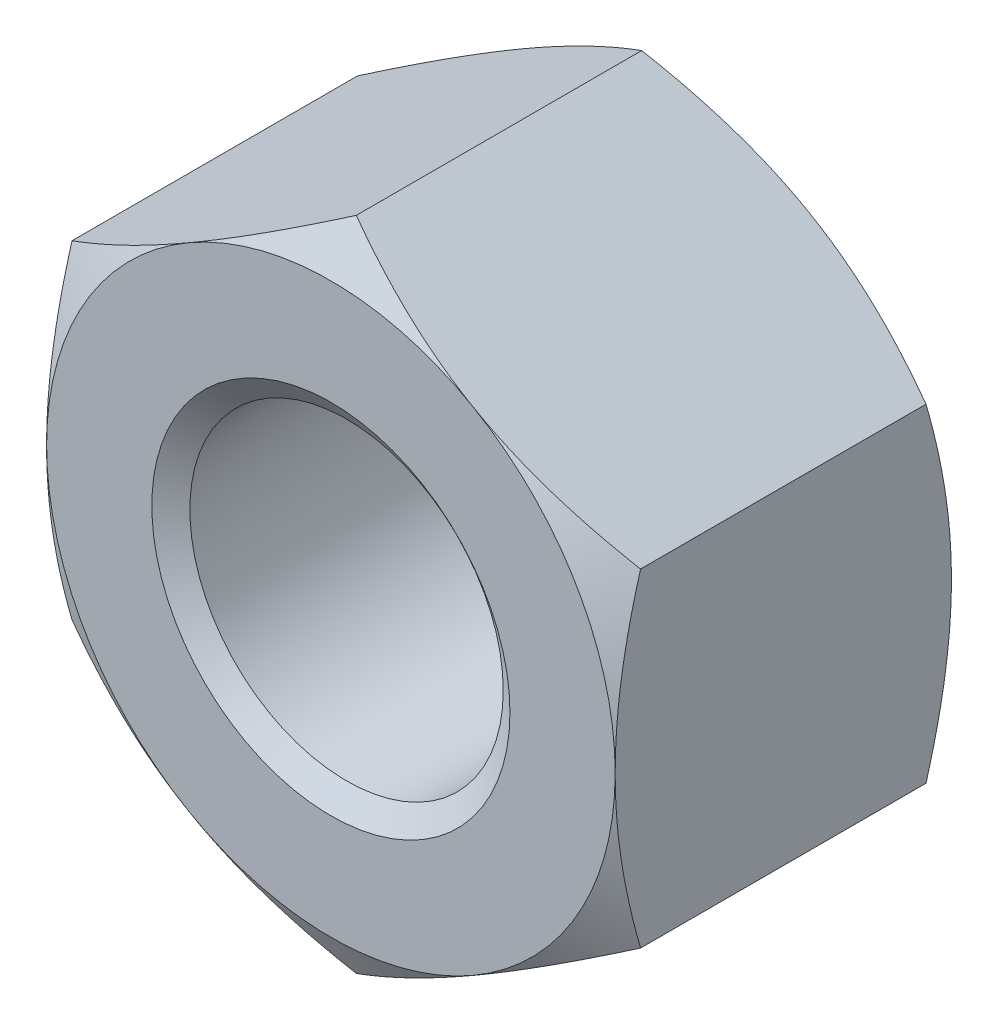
ISO-10303-21;
HEADER;
FILE_DESCRIPTION(('STEP AP214'),'2;1');
FILE_NAME('part.step','',(''),(''),'','','');
FILE_SCHEMA(('AUTOMOTIVE_DESIGN { 1 0 10303 214 1 1 1 1 }'));
ENDSEC;
DATA;
#1=APPLICATION_CONTEXT('core data for automotive mechanical design processes');
#2=APPLICATION_PROTOCOL_DEFINITION('international standard','automotive_design',2000,#1);
#3=PRODUCT_CONTEXT('',#1,'mechanical');
#4=PRODUCT('Part','Part','',(#3));
#5=PRODUCT_RELATED_PRODUCT_CATEGORY('part','',(#4));
#6=PRODUCT_DEFINITION_FORMATION('','',#4);
#7=PRODUCT_DEFINITION_CONTEXT('part definition',#1,'design');
#8=PRODUCT_DEFINITION('design','',#6,#7);
#9=PRODUCT_DEFINITION_SHAPE('','',#8);
#10=(LENGTH_UNIT() NAMED_UNIT(*) SI_UNIT(.MILLI.,.METRE.));
#11=(NAMED_UNIT(*) PLANE_ANGLE_UNIT() SI_UNIT($,.RADIAN.));
#12=(NAMED_UNIT(*) SI_UNIT($,.STERADIAN.) SOLID_ANGLE_UNIT());
#13=UNCERTAINTY_MEASURE_WITH_UNIT(LENGTH_MEASURE(1.E-05),#10,'distance_accuracy_value','');
#14=(GEOMETRIC_REPRESENTATION_CONTEXT(3) GLOBAL_UNCERTAINTY_ASSIGNED_CONTEXT((#13)) GLOBAL_UNIT_ASSIGNED_CONTEXT((#10,
#11,#12)) REPRESENTATION_CONTEXT('',''));
#15=CARTESIAN_POINT('',(0.,0.,0.));
#16=DIRECTION('',(0.,0.,1.));
#17=DIRECTION('',(1.,0.,0.));
#18=AXIS2_PLACEMENT_3D('',#15,#16,#17);
#19=CARTESIAN_POINT('',(0.,0.,-22.5298));
#20=DIRECTION('',(0.,0.,1.));
#21=DIRECTION('',(1.,0.,0.));
#22=AXIS2_PLACEMENT_3D('',#19,#20,#21);
#23=CYLINDRICAL_SURFACE('',#22,10.5);
#24=CARTESIAN_POINT('',(0.,0.,-1.05031130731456));
#25=DIRECTION('',(0.,0.,1.));
#26=DIRECTION('',(1.,0.,0.));
#27=AXIS2_PLACEMENT_3D('',#24,#25,#26);
#28=CIRCLE('',#27,10.5);
#29=CARTESIAN_POINT('',(10.5,0.,-1.05031130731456));
#30=VERTEX_POINT('',#29);
#31=EDGE_CURVE('E150',#30,#30,#28,.F.);
#32=ORIENTED_EDGE('',*,*,#31,.F.);
#33=EDGE_LOOP('',(#32));
#34=FACE_BOUND('',#33,.T.);
#35=CARTESIAN_POINT('',(0.,0.,-21.4540886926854));
#36=DIRECTION('',(0.,0.,-1.));
#37=DIRECTION('',(-1.,0.,0.));
#38=AXIS2_PLACEMENT_3D('',#35,#36,#37);
#39=CIRCLE('',#38,10.5);
#40=CARTESIAN_POINT('',(-10.5,0.,-21.4540886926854));
#41=VERTEX_POINT('',#40);
#42=EDGE_CURVE('E40',#41,#41,#39,.F.);
#43=ORIENTED_EDGE('',*,*,#42,.F.);
#44=EDGE_LOOP('',(#43));
#45=FACE_BOUND('',#44,.T.);
#46=ADVANCED_FACE('F35',(#34,#45),#23,.F.);
#47=CARTESIAN_POINT('',(-38.1,0.,-22.5298));
#48=DIRECTION('',(0.,0.,1.));
#49=DIRECTION('',(1.,0.,0.));
#50=AXIS2_PLACEMENT_3D('',#47,#48,#49);
#51=PLANE('',#50);
#52=CARTESIAN_POINT('',(0.,0.,-22.5298));
#53=DIRECTION('',(0.,0.,1.));
#54=DIRECTION('',(1.,0.,0.));
#55=AXIS2_PLACEMENT_3D('',#52,#53,#54);
#56=CIRCLE('',#55,19.05);
#57=CARTESIAN_POINT('',(19.05,0.,-22.5298));
#58=VERTEX_POINT('',#57);
#59=CARTESIAN_POINT('',(9.52500000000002,16.4977839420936,-22.5298));
#60=VERTEX_POINT('',#59);
#61=EDGE_CURVE('E157',#58,#60,#56,.T.);
#62=ORIENTED_EDGE('',*,*,#61,.F.);
#63=CARTESIAN_POINT('',(0.,0.,-22.5298));
#64=DIRECTION('',(0.,0.,1.));
#65=DIRECTION('',(1.,0.,0.));
#66=AXIS2_PLACEMENT_3D('',#63,#64,#65);
#67=CIRCLE('',#66,19.05);
#68=CARTESIAN_POINT('',(9.52500000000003,-16.4977839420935,-22.5298));
#69=VERTEX_POINT('',#68);
#70=EDGE_CURVE('E262',#58,#69,#67,.F.);
#71=ORIENTED_EDGE('',*,*,#70,.T.);
#72=CARTESIAN_POINT('',(-9.52500000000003,-16.4977839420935,-22.5298));
#73=VERTEX_POINT('',#72);
#74=EDGE_CURVE('E264',#69,#73,#67,.F.);
#75=ORIENTED_EDGE('',*,*,#74,.T.);
#76=CARTESIAN_POINT('',(-19.05,0.,-22.5298));
#77=VERTEX_POINT('',#76);
#78=EDGE_CURVE('E389',#73,#77,#67,.F.);
#79=ORIENTED_EDGE('',*,*,#78,.T.);
#80=CARTESIAN_POINT('',(-9.52500000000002,16.4977839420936,-22.5298));
#81=VERTEX_POINT('',#80);
#82=EDGE_CURVE('E392',#77,#81,#67,.F.);
#83=ORIENTED_EDGE('',*,*,#82,.T.);
#84=EDGE_CURVE('E247',#81,#60,#67,.F.);
#85=ORIENTED_EDGE('',*,*,#84,.T.);
#86=EDGE_LOOP('',(#62,#71,#75,#79,#83,#85));
#87=FACE_BOUND('',#86,.T.);
#88=CARTESIAN_POINT('',(0.,0.,-22.5298));
#89=DIRECTION('',(0.,0.,1.));
#90=DIRECTION('',(1.,0.,0.));
#91=AXIS2_PLACEMENT_3D('',#88,#89,#90);
#92=CIRCLE('',#91,12.);
#93=CARTESIAN_POINT('',(12.,0.,-22.5298));
#94=VERTEX_POINT('',#93);
#95=EDGE_CURVE('E269',#94,#94,#92,.F.);
#96=ORIENTED_EDGE('',*,*,#95,.F.);
#97=EDGE_LOOP('',(#96));
#98=FACE_BOUND('',#97,.T.);
#99=ADVANCED_FACE('F285',(#87,#98),#51,.F.);
#100=CARTESIAN_POINT('',(-38.1,0.,0.));
#101=DIRECTION('',(0.,0.,1.));
#102=DIRECTION('',(1.,0.,0.));
#103=AXIS2_PLACEMENT_3D('',#100,#101,#102);
#104=PLANE('',#103);
#105=CARTESIAN_POINT('',(0.,0.,0.));
#106=DIRECTION('',(0.,0.,1.));
#107=DIRECTION('',(1.,0.,0.));
#108=AXIS2_PLACEMENT_3D('',#105,#106,#107);
#109=CIRCLE('',#108,19.05);
#110=CARTESIAN_POINT('',(9.52500000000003,-16.4977839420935,0.));
#111=VERTEX_POINT('',#110);
#112=CARTESIAN_POINT('',(19.05,0.,0.));
#113=VERTEX_POINT('',#112);
#114=EDGE_CURVE('E47',#111,#113,#109,.T.);
#115=ORIENTED_EDGE('',*,*,#114,.T.);
#116=CARTESIAN_POINT('',(0.,0.,0.));
#117=DIRECTION('',(0.,0.,1.));
#118=DIRECTION('',(1.,0.,0.));
#119=AXIS2_PLACEMENT_3D('',#116,#117,#118);
#120=CIRCLE('',#119,19.05);
#121=CARTESIAN_POINT('',(9.52500000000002,16.4977839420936,0.));
#122=VERTEX_POINT('',#121);
#123=EDGE_CURVE('E54',#113,#122,#120,.T.);
#124=ORIENTED_EDGE('',*,*,#123,.T.);
#125=CARTESIAN_POINT('',(-9.52500000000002,16.4977839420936,0.));
#126=VERTEX_POINT('',#125);
#127=EDGE_CURVE('E11',#122,#126,#109,.T.);
#128=ORIENTED_EDGE('',*,*,#127,.T.);
#129=CARTESIAN_POINT('',(-19.05,0.,0.));
#130=VERTEX_POINT('',#129);
#131=EDGE_CURVE('E45',#126,#130,#109,.T.);
#132=ORIENTED_EDGE('',*,*,#131,.T.);
#133=CARTESIAN_POINT('',(-9.52500000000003,-16.4977839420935,0.));
#134=VERTEX_POINT('',#133);
#135=EDGE_CURVE('E338',#130,#134,#109,.T.);
#136=ORIENTED_EDGE('',*,*,#135,.T.);
#137=EDGE_CURVE('E266',#134,#111,#109,.T.);
#138=ORIENTED_EDGE('',*,*,#137,.T.);
#139=EDGE_LOOP('',(#115,#124,#128,#132,#136,#138));
#140=FACE_BOUND('',#139,.T.);
#141=CARTESIAN_POINT('',(0.,0.,0.));
#142=DIRECTION('',(0.,0.,1.));
#143=DIRECTION('',(1.,0.,0.));
#144=AXIS2_PLACEMENT_3D('',#141,#142,#143);
#145=CIRCLE('',#144,12.);
#146=CARTESIAN_POINT('',(12.,0.,0.));
#147=VERTEX_POINT('',#146);
#148=EDGE_CURVE('E268',#147,#147,#145,.T.);
#149=ORIENTED_EDGE('',*,*,#148,.F.);
#150=EDGE_LOOP('',(#149));
#151=FACE_BOUND('',#150,.T.);
#152=ADVANCED_FACE('F145',(#140,#151),#104,.T.);
#153=CARTESIAN_POINT('',(0.,21.9970452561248,-22.5298));
#154=DIRECTION('',(-0.500000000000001,0.866025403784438,0.));
#155=DIRECTION('',(-0.866025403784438,-0.500000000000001,0.));
#156=AXIS2_PLACEMENT_3D('',#153,#154,#155);
#157=PLANE('',#156);
#158=DIRECTION('',(0.,0.,1.));
#159=VECTOR('',#158,1.);
#160=CARTESIAN_POINT('',(-19.05,10.9985226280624,-22.5298));
#161=LINE('',#160,#159);
#162=CARTESIAN_POINT('',(-19.05,10.9985226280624,-20.8283226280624));
#163=VERTEX_POINT('',#162);
#164=CARTESIAN_POINT('',(-19.05,10.9985226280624,-1.70147737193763));
#165=VERTEX_POINT('',#164);
#166=EDGE_CURVE('E259',#163,#165,#161,.T.);
#167=ORIENTED_EDGE('',*,*,#166,.T.);
#168=CARTESIAN_POINT('',(-19.0502,10.9984071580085,-1.70154403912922));
#169=CARTESIAN_POINT('',(-18.6314889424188,11.2401500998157,-1.56198341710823));
#170=CARTESIAN_POINT('',(-18.2111446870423,11.4828359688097,-1.42875584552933));
#171=CARTESIAN_POINT('',(-17.3670855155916,11.9701537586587,-1.17672716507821));
#172=CARTESIAN_POINT('',(-16.9433695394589,12.2147862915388,-1.05793080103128));
#173=CARTESIAN_POINT('',(-16.0917480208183,12.7064702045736,-0.836361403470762));
#174=CARTESIAN_POINT('',(-15.6638350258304,12.9535258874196,-0.733626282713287));
#175=CARTESIAN_POINT('',(-14.8050356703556,13.4493539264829,-0.546385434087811));
#176=CARTESIAN_POINT('',(-14.374149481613,13.6981261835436,-0.461878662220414));
#177=CARTESIAN_POINT('',(-13.5204444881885,14.1910129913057,-0.314688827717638));
#178=CARTESIAN_POINT('',(-13.0976890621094,14.4350909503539,-0.251518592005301));
#179=CARTESIAN_POINT('',(-12.250241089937,14.9243652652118,-0.14559634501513));
#180=CARTESIAN_POINT('',(-11.8255485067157,15.1695616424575,-0.102844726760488));
#181=CARTESIAN_POINT('',(-10.9754499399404,15.6603662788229,-0.0388391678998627));
#182=CARTESIAN_POINT('',(-10.5500454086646,15.9059736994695,-0.017559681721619));
#183=CARTESIAN_POINT('',(-9.6988436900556,16.397415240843,0.00304398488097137));
#184=CARTESIAN_POINT('',(-9.27304651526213,16.6432493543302,0.00236884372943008));
#185=CARTESIAN_POINT('',(-8.47700964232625,17.1028414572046,-0.0194033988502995));
#186=CARTESIAN_POINT('',(-8.10671322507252,17.316632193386,-0.0378455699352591));
#187=CARTESIAN_POINT('',(-7.36700369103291,17.7437036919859,-0.0909844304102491));
#188=CARTESIAN_POINT('',(-6.99759056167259,17.9569844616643,-0.125680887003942));
#189=CARTESIAN_POINT('',(-6.25978756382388,18.3829552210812,-0.21072627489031));
#190=CARTESIAN_POINT('',(-5.89139892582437,18.5956445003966,-0.261089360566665));
#191=CARTESIAN_POINT('',(-5.15637533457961,19.0200105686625,-0.376579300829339));
#192=CARTESIAN_POINT('',(-4.78974037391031,19.2316873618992,-0.441706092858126));
#193=CARTESIAN_POINT('',(-3.67677271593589,19.8742595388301,-0.660888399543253));
#194=CARTESIAN_POINT('',(-2.93366305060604,20.3032941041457,-0.836799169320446));
#195=CARTESIAN_POINT('',(-1.45852420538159,21.1549659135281,-1.23604434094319));
#196=CARTESIAN_POINT('',(-0.726476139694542,21.5776140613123,-1.45928498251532));
#197=CARTESIAN_POINT('',(0.000199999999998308,21.9971607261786,-1.70154403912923));
#198=B_SPLINE_CURVE_WITH_KNOTS('',3,(#168,#169,#170,#171,#172,#173,#174,#175,#176,#177,#178,
#179,#180,#181,#182,#183,#184,#185,#186,#187,#188,#189,#190,#191,#192,#193,#194,#195,#196,#197),
.UNSPECIFIED.,.F.,.F.,(4,2,2,2,2,2,2,2,2,2,2,2,2,2,4),(0.,1.50971559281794,3.01992622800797,
4.53364959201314,6.04728623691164,7.52356313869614,8.99986845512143,10.4744153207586,
11.9489166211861,13.2325441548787,14.5161533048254,15.8009255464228,17.085692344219,
19.7118183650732,22.3327898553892),.UNSPECIFIED.);
#199=EDGE_CURVE('E62',#165,#126,#198,.T.);
#200=ORIENTED_EDGE('',*,*,#199,.T.);
#201=CARTESIAN_POINT('',(0.,21.9970452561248,-1.70147737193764));
#202=VERTEX_POINT('',#201);
#203=EDGE_CURVE('E141',#126,#202,#198,.T.);
#204=ORIENTED_EDGE('',*,*,#203,.T.);
#205=DIRECTION('',(0.,0.,1.));
#206=VECTOR('',#205,1.);
#207=CARTESIAN_POINT('',(0.,21.9970452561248,-22.5298));
#208=LINE('',#207,#206);
#209=CARTESIAN_POINT('',(0.,21.9970452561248,-20.8283226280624));
#210=VERTEX_POINT('',#209);
#211=EDGE_CURVE('E156',#210,#202,#208,.T.);
#212=ORIENTED_EDGE('',*,*,#211,.F.);
#213=CARTESIAN_POINT('',(-19.0502,10.9984071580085,-20.8282559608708));
#214=CARTESIAN_POINT('',(-18.6314889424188,11.2401500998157,-20.9678165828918));
#215=CARTESIAN_POINT('',(-18.2111446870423,11.4828359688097,-21.1010441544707));
#216=CARTESIAN_POINT('',(-17.3670855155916,11.9701537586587,-21.3530728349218));
#217=CARTESIAN_POINT('',(-16.9433695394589,12.2147862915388,-21.4718691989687));
#218=CARTESIAN_POINT('',(-16.0917480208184,12.7064702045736,-21.6934385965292));
#219=CARTESIAN_POINT('',(-15.6638350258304,12.9535258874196,-21.7961737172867));
#220=CARTESIAN_POINT('',(-14.8050356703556,13.4493539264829,-21.9834145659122));
#221=CARTESIAN_POINT('',(-14.374149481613,13.6981261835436,-22.0679213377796));
#222=CARTESIAN_POINT('',(-13.5204444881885,14.1910129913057,-22.2151111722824));
#223=CARTESIAN_POINT('',(-13.0976890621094,14.4350909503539,-22.2782814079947));
#224=CARTESIAN_POINT('',(-12.250241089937,14.9243652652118,-22.3842036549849));
#225=CARTESIAN_POINT('',(-11.8255485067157,15.1695616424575,-22.4269552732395));
#226=CARTESIAN_POINT('',(-10.9754499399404,15.6603662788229,-22.4909608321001));
#227=CARTESIAN_POINT('',(-10.5500454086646,15.9059736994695,-22.5122403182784));
#228=CARTESIAN_POINT('',(-9.6988436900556,16.397415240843,-22.532843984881));
#229=CARTESIAN_POINT('',(-9.27304651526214,16.6432493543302,-22.5321688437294));
#230=CARTESIAN_POINT('',(-8.47700964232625,17.1028414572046,-22.5103966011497));
#231=CARTESIAN_POINT('',(-8.10671322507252,17.316632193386,-22.4919544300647));
#232=CARTESIAN_POINT('',(-7.3670036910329,17.7437036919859,-22.4388155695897));
#233=CARTESIAN_POINT('',(-6.99759056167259,17.9569844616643,-22.4041191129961));
#234=CARTESIAN_POINT('',(-6.25978756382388,18.3829552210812,-22.3190737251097));
#235=CARTESIAN_POINT('',(-5.89139892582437,18.5956445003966,-22.2687106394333));
#236=CARTESIAN_POINT('',(-5.15637533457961,19.0200105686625,-22.1532206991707));
#237=CARTESIAN_POINT('',(-4.78974037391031,19.2316873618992,-22.0880939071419));
#238=CARTESIAN_POINT('',(-3.67677271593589,19.8742595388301,-21.8689116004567));
#239=CARTESIAN_POINT('',(-2.93366305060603,20.3032941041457,-21.6930008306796));
#240=CARTESIAN_POINT('',(-1.45852420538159,21.1549659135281,-21.2937556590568));
#241=CARTESIAN_POINT('',(-0.72647613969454,21.5776140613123,-21.0705150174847));
#242=CARTESIAN_POINT('',(0.000199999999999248,21.9971607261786,-20.8282559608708));
#243=B_SPLINE_CURVE_WITH_KNOTS('',3,(#213,#214,#215,#216,#217,#218,#219,#220,#221,#222,#223,
#224,#225,#226,#227,#228,#229,#230,#231,#232,#233,#234,#235,#236,#237,#238,#239,#240,#241,#242),
.UNSPECIFIED.,.F.,.F.,(4,2,2,2,2,2,2,2,2,2,2,2,2,2,4),(0.,1.50971559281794,3.01992622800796,
4.53364959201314,6.04728623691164,7.52356313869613,8.99986845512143,10.4744153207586,
11.9489166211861,13.2325441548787,14.5161533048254,15.8009255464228,17.085692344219,
19.7118183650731,22.3327898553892),.UNSPECIFIED.);
#244=EDGE_CURVE('E239',#81,#210,#243,.T.);
#245=ORIENTED_EDGE('',*,*,#244,.F.);
#246=EDGE_CURVE('E227',#163,#81,#243,.T.);
#247=ORIENTED_EDGE('',*,*,#246,.F.);
#248=EDGE_LOOP('',(#167,#200,#204,#212,#245,#247));
#249=FACE_BOUND('',#248,.T.);
#250=ADVANCED_FACE('F37',(#249),#157,.T.);
#251=CARTESIAN_POINT('',(19.05,10.9985226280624,-22.5298));
#252=DIRECTION('',(0.500000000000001,0.866025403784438,0.));
#253=DIRECTION('',(-0.866025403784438,0.500000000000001,0.));
#254=AXIS2_PLACEMENT_3D('',#251,#252,#253);
#255=PLANE('',#254);
#256=ORIENTED_EDGE('',*,*,#211,.T.);
#257=CARTESIAN_POINT('',(-0.000200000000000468,21.9971607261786,-1.70154403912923));
#258=CARTESIAN_POINT('',(0.418511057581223,21.7554177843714,-1.56198341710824));
#259=CARTESIAN_POINT('',(0.83885531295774,21.5127319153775,-1.42875584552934));
#260=CARTESIAN_POINT('',(1.68291448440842,21.0254141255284,-1.17672716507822));
#261=CARTESIAN_POINT('',(2.10663046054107,20.7807815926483,-1.05793080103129));
#262=CARTESIAN_POINT('',(2.95825197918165,20.2890976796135,-0.836361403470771));
#263=CARTESIAN_POINT('',(3.38616497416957,20.0420419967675,-0.733626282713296));
#264=CARTESIAN_POINT('',(4.24496432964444,19.5462139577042,-0.546385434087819));
#265=CARTESIAN_POINT('',(4.67585051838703,19.2974417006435,-0.461878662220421));
#266=CARTESIAN_POINT('',(5.52955551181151,18.8045548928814,-0.314688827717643));
#267=CARTESIAN_POINT('',(5.95231093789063,18.5604769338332,-0.251518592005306));
#268=CARTESIAN_POINT('',(6.799758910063,18.0712026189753,-0.145596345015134));
#269=CARTESIAN_POINT('',(7.22445149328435,17.8260062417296,-0.102844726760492));
#270=CARTESIAN_POINT('',(8.07455006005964,17.3352016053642,-0.0388391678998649));
#271=CARTESIAN_POINT('',(8.49995459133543,17.0895941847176,-0.0175596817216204));
#272=CARTESIAN_POINT('',(9.35115630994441,16.5981526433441,0.00304398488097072));
#273=CARTESIAN_POINT('',(9.77695348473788,16.3523185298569,0.0023688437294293));
#274=CARTESIAN_POINT('',(10.5729903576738,15.8927264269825,-0.0194033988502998));
#275=CARTESIAN_POINT('',(10.9432867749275,15.6789356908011,-0.0378455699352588));
#276=CARTESIAN_POINT('',(11.6829963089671,15.2518641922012,-0.0909844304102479));
#277=CARTESIAN_POINT('',(12.0524094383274,15.0385834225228,-0.125680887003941));
#278=CARTESIAN_POINT('',(12.7902124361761,14.6126126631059,-0.210726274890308));
#279=CARTESIAN_POINT('',(13.1586010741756,14.3999233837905,-0.261089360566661));
#280=CARTESIAN_POINT('',(13.8936246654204,13.9755573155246,-0.376579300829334));
#281=CARTESIAN_POINT('',(14.2602596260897,13.7638805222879,-0.441706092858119));
#282=CARTESIAN_POINT('',(15.3732272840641,13.121308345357,-0.660888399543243));
#283=CARTESIAN_POINT('',(16.116336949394,12.6922737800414,-0.836799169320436));
#284=CARTESIAN_POINT('',(17.5914757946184,11.840601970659,-1.23604434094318));
#285=CARTESIAN_POINT('',(18.3235238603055,11.4179538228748,-1.45928498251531));
#286=CARTESIAN_POINT('',(19.0502,10.9984071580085,-1.70154403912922));
#287=B_SPLINE_CURVE_WITH_KNOTS('',3,(#257,#258,#259,#260,#261,#262,#263,#264,#265,#266,#267,
#268,#269,#270,#271,#272,#273,#274,#275,#276,#277,#278,#279,#280,#281,#282,#283,#284,#285,#286),
.UNSPECIFIED.,.F.,.F.,(4,2,2,2,2,2,2,2,2,2,2,2,2,2,4),(0.,1.50971559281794,3.01992622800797,
4.53364959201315,6.04728623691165,7.52356313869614,8.99986845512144,10.4744153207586,
11.9489166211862,13.2325441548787,14.5161533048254,15.8009255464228,17.085692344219,
19.7118183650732,22.3327898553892),.UNSPECIFIED.);
#288=EDGE_CURVE('E136',#202,#122,#287,.T.);
#289=ORIENTED_EDGE('',*,*,#288,.T.);
#290=CARTESIAN_POINT('',(19.05,10.9985226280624,-1.70147737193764));
#291=VERTEX_POINT('',#290);
#292=EDGE_CURVE('E127',#122,#291,#287,.T.);
#293=ORIENTED_EDGE('',*,*,#292,.T.);
#294=DIRECTION('',(0.,0.,1.));
#295=VECTOR('',#294,1.);
#296=CARTESIAN_POINT('',(19.05,10.9985226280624,-22.5298));
#297=LINE('',#296,#295);
#298=CARTESIAN_POINT('',(19.05,10.9985226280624,-20.8283226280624));
#299=VERTEX_POINT('',#298);
#300=EDGE_CURVE('E248',#299,#291,#297,.T.);
#301=ORIENTED_EDGE('',*,*,#300,.F.);
#302=CARTESIAN_POINT('',(-0.000200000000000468,21.9971607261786,-20.8282559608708));
#303=CARTESIAN_POINT('',(0.418511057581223,21.7554177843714,-20.9678165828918));
#304=CARTESIAN_POINT('',(0.83885531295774,21.5127319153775,-21.1010441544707));
#305=CARTESIAN_POINT('',(1.68291448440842,21.0254141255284,-21.3530728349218));
#306=CARTESIAN_POINT('',(2.10663046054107,20.7807815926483,-21.4718691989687));
#307=CARTESIAN_POINT('',(2.95825197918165,20.2890976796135,-21.6934385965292));
#308=CARTESIAN_POINT('',(3.38616497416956,20.0420419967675,-21.7961737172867));
#309=CARTESIAN_POINT('',(4.24496432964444,19.5462139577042,-21.9834145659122));
#310=CARTESIAN_POINT('',(4.67585051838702,19.2974417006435,-22.0679213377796));
#311=CARTESIAN_POINT('',(5.52955551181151,18.8045548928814,-22.2151111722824));
#312=CARTESIAN_POINT('',(5.95231093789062,18.5604769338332,-22.2782814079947));
#313=CARTESIAN_POINT('',(6.79975891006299,18.0712026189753,-22.3842036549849));
#314=CARTESIAN_POINT('',(7.22445149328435,17.8260062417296,-22.4269552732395));
#315=CARTESIAN_POINT('',(8.07455006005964,17.3352016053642,-22.4909608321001));
#316=CARTESIAN_POINT('',(8.49995459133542,17.0895941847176,-22.5122403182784));
#317=CARTESIAN_POINT('',(9.3511563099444,16.5981526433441,-22.532843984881));
#318=CARTESIAN_POINT('',(9.77695348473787,16.3523185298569,-22.5321688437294));
#319=CARTESIAN_POINT('',(10.5729903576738,15.8927264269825,-22.5103966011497));
#320=CARTESIAN_POINT('',(10.9432867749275,15.6789356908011,-22.4919544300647));
#321=CARTESIAN_POINT('',(11.6829963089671,15.2518641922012,-22.4388155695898));
#322=CARTESIAN_POINT('',(12.0524094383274,15.0385834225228,-22.4041191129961));
#323=CARTESIAN_POINT('',(12.7902124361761,14.612612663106,-22.3190737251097));
#324=CARTESIAN_POINT('',(13.1586010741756,14.3999233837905,-22.2687106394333));
#325=CARTESIAN_POINT('',(13.8936246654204,13.9755573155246,-22.1532206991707));
#326=CARTESIAN_POINT('',(14.2602596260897,13.7638805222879,-22.0880939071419));
#327=CARTESIAN_POINT('',(15.3732272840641,13.121308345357,-21.8689116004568));
#328=CARTESIAN_POINT('',(16.116336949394,12.6922737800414,-21.6930008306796));
#329=CARTESIAN_POINT('',(17.5914757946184,11.840601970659,-21.2937556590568));
#330=CARTESIAN_POINT('',(18.3235238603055,11.4179538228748,-21.0705150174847));
#331=CARTESIAN_POINT('',(19.0502,10.9984071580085,-20.8282559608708));
#332=B_SPLINE_CURVE_WITH_KNOTS('',3,(#302,#303,#304,#305,#306,#307,#308,#309,#310,#311,#312,
#313,#314,#315,#316,#317,#318,#319,#320,#321,#322,#323,#324,#325,#326,#327,#328,#329,#330,#331),
.UNSPECIFIED.,.F.,.F.,(4,2,2,2,2,2,2,2,2,2,2,2,2,2,4),(0.,1.50971559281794,3.01992622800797,
4.53364959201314,6.04728623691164,7.52356313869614,8.99986845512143,10.4744153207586,
11.9489166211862,13.2325441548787,14.5161533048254,15.8009255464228,17.085692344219,
19.7118183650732,22.3327898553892),.UNSPECIFIED.);
#333=EDGE_CURVE('E240',#60,#299,#332,.T.);
#334=ORIENTED_EDGE('',*,*,#333,.F.);
#335=EDGE_CURVE('E245',#210,#60,#332,.T.);
#336=ORIENTED_EDGE('',*,*,#335,.F.);
#337=EDGE_LOOP('',(#256,#289,#293,#301,#334,#336));
#338=FACE_BOUND('',#337,.T.);
#339=ADVANCED_FACE('F153',(#338),#255,.T.);
#340=CARTESIAN_POINT('',(19.05,10.9985226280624,-22.5298));
#341=DIRECTION('',(-1.,0.,0.));
#342=DIRECTION('',(0.,0.,1.));
#343=AXIS2_PLACEMENT_3D('',#340,#341,#342);
#344=PLANE('',#343);
#345=CARTESIAN_POINT('',(19.05,-29.169702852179,-9.11593373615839));
#346=CARTESIAN_POINT('',(19.05,-28.7515170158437,-8.91378890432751));
#347=CARTESIAN_POINT('',(19.05,-28.3328257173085,-8.71269026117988));
#348=CARTESIAN_POINT('',(19.05,-27.494325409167,-8.31282549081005));
#349=CARTESIAN_POINT('',(19.05,-27.0745163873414,-8.11405938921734));
#350=CARTESIAN_POINT('',(19.05,-25.813129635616,-7.52156252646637));
#351=CARTESIAN_POINT('',(19.05,-24.9697281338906,-7.13169909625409));
#352=CARTESIAN_POINT('',(19.05,-23.2722707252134,-6.36257122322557));
#353=CARTESIAN_POINT('',(19.05,-22.4181814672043,-5.98338020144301));
#354=CARTESIAN_POINT('',(19.05,-20.7029839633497,-5.24127883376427));
#355=CARTESIAN_POINT('',(19.05,-19.8418760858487,-4.87836763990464));
#356=CARTESIAN_POINT('',(19.05,-18.1005821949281,-4.1688569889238));
#357=CARTESIAN_POINT('',(19.05,-17.2202917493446,-3.82251248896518));
#358=CARTESIAN_POINT('',(19.05,-15.4493217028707,-3.15694792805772));
#359=CARTESIAN_POINT('',(19.05,-14.5586409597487,-2.83773088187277));
#360=CARTESIAN_POINT('',(19.05,-12.7673320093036,-2.2350028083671));
#361=CARTESIAN_POINT('',(19.05,-11.8667295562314,-1.95141586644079));
#362=CARTESIAN_POINT('',(19.05,-10.0526343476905,-1.42914392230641));
#363=CARTESIAN_POINT('',(19.05,-9.13914576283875,-1.19044473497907));
#364=CARTESIAN_POINT('',(19.05,-7.7590746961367,-0.874799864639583));
#365=CARTESIAN_POINT('',(19.05,-7.29731333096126,-0.776636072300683));
#366=CARTESIAN_POINT('',(19.05,-6.37071732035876,-0.595993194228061));
#367=CARTESIAN_POINT('',(19.05,-5.90588274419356,-0.513513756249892));
#368=CARTESIAN_POINT('',(19.05,-4.97345228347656,-0.365701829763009));
#369=CARTESIAN_POINT('',(19.05,-4.50585623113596,-0.300370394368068));
#370=CARTESIAN_POINT('',(19.05,-3.56843861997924,-0.188166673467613));
#371=CARTESIAN_POINT('',(19.05,-3.09861705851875,-0.141294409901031));
#372=CARTESIAN_POINT('',(19.05,-2.16041609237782,-0.0672708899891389));
#373=CARTESIAN_POINT('',(19.05,-1.69204648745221,-0.0399962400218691));
#374=CARTESIAN_POINT('',(19.05,-0.754574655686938,-0.00531133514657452));
#375=CARTESIAN_POINT('',(19.05,-0.285472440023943,0.00209921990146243));
#376=CARTESIAN_POINT('',(19.05,0.652492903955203,-0.00311981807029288));
#377=CARTESIAN_POINT('',(19.05,1.12135606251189,-0.0157438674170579));
#378=CARTESIAN_POINT('',(19.05,2.05813737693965,-0.0607182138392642));
#379=CARTESIAN_POINT('',(19.05,2.52605549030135,-0.0930693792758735));
#380=CARTESIAN_POINT('',(19.05,3.65980250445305,-0.194680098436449));
#381=CARTESIAN_POINT('',(19.05,4.32476458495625,-0.273803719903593));
#382=CARTESIAN_POINT('',(19.05,5.64947952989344,-0.467485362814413));
#383=CARTESIAN_POINT('',(19.05,6.30923160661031,-0.582048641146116));
#384=CARTESIAN_POINT('',(19.05,8.28182382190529,-0.973151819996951));
#385=CARTESIAN_POINT('',(19.05,9.58542312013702,-1.29684470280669));
#386=CARTESIAN_POINT('',(19.05,11.5353898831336,-1.85499845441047));
#387=CARTESIAN_POINT('',(19.05,12.191945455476,-2.05588340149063));
#388=CARTESIAN_POINT('',(19.05,13.498713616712,-2.47768236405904));
#389=CARTESIAN_POINT('',(19.05,14.1489256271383,-2.69859818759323));
#390=CARTESIAN_POINT('',(19.05,15.4397656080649,-3.15575174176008));
#391=CARTESIAN_POINT('',(19.05,16.0804269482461,-3.39189604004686));
#392=CARTESIAN_POINT('',(19.05,17.0373840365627,-3.75633654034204));
#393=CARTESIAN_POINT('',(19.05,17.3556458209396,-3.87949985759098));
#394=CARTESIAN_POINT('',(19.05,17.9909330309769,-4.12895791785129));
#395=CARTESIAN_POINT('',(19.05,18.3079584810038,-4.25525259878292));
#396=CARTESIAN_POINT('',(19.05,18.6244086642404,-4.38297164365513));
#397=B_SPLINE_CURVE_WITH_KNOTS('',3,(#345,#346,#347,#348,#349,#350,#351,#352,#353,#354,#355,
#356,#357,#358,#359,#360,#361,#362,#363,#364,#365,#366,#367,#368,#369,#370,#371,#372,#373,#374,
#375,#376,#377,#378,#379,#380,#381,#382,#383,#384,#385,#386,#387,#388,#389,#390,#391,#392,#393,
#394,#395,#396),.UNSPECIFIED.,.F.,.F.,(4,2,2,2,2,2,2,2,2,2,2,2,2,2,2,2,2,2,2,2,2,2,2,2,2,4),(0.,
1.39343811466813,2.78689152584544,5.57425145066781,8.37756231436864,11.1807269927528,
14.0183059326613,16.856199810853,19.6879407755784,22.5187853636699,23.934802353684,
25.3507875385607,26.766859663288,28.1829334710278,29.5900111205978,30.9970675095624,
32.4037346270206,33.8104636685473,35.8182820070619,37.8263983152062,41.8503661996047,
43.9100054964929,45.9698308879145,48.0180400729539,49.0418117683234,50.0655631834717),.UNSPECIFIED.);
#398=CARTESIAN_POINT('',(19.05,-10.9985226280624,-1.70147737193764));
#399=VERTEX_POINT('',#398);
#400=EDGE_CURVE('E207',#399,#113,#397,.T.);
#401=ORIENTED_EDGE('',*,*,#400,.F.);
#402=DIRECTION('',(0.,0.,1.));
#403=VECTOR('',#402,1.);
#404=CARTESIAN_POINT('',(19.05,-10.9985226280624,-22.5298));
#405=LINE('',#404,#403);
#406=CARTESIAN_POINT('',(19.05,-10.9985226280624,-20.8283226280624));
#407=VERTEX_POINT('',#406);
#408=EDGE_CURVE('E250',#407,#399,#405,.T.);
#409=ORIENTED_EDGE('',*,*,#408,.F.);
#410=CARTESIAN_POINT('',(19.05,-29.169702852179,-13.4138662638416));
#411=CARTESIAN_POINT('',(19.05,-28.7515170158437,-13.6160110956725));
#412=CARTESIAN_POINT('',(19.05,-28.3328257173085,-13.8171097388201));
#413=CARTESIAN_POINT('',(19.05,-27.494325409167,-14.21697450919));
#414=CARTESIAN_POINT('',(19.05,-27.0745163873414,-14.4157406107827));
#415=CARTESIAN_POINT('',(19.05,-25.8131296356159,-15.0082374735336));
#416=CARTESIAN_POINT('',(19.05,-24.9697281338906,-15.3981009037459));
#417=CARTESIAN_POINT('',(19.05,-23.2722707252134,-16.1672287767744));
#418=CARTESIAN_POINT('',(19.05,-22.4181814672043,-16.546419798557));
#419=CARTESIAN_POINT('',(19.05,-20.7029839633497,-17.2885211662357));
#420=CARTESIAN_POINT('',(19.05,-19.8418760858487,-17.6514323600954));
#421=CARTESIAN_POINT('',(19.05,-18.1005821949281,-18.3609430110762));
#422=CARTESIAN_POINT('',(19.05,-17.2202917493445,-18.7072875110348));
#423=CARTESIAN_POINT('',(19.05,-15.4493217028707,-19.3728520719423));
#424=CARTESIAN_POINT('',(19.05,-14.5586409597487,-19.6920691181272));
#425=CARTESIAN_POINT('',(19.05,-12.7673320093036,-20.2947971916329));
#426=CARTESIAN_POINT('',(19.05,-11.8667295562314,-20.5783841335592));
#427=CARTESIAN_POINT('',(19.05,-10.0526343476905,-21.1006560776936));
#428=CARTESIAN_POINT('',(19.05,-9.13914576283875,-21.3393552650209));
#429=CARTESIAN_POINT('',(19.05,-7.7590746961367,-21.6550001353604));
#430=CARTESIAN_POINT('',(19.05,-7.29731333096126,-21.7531639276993));
#431=CARTESIAN_POINT('',(19.05,-6.37071732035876,-21.9338068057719));
#432=CARTESIAN_POINT('',(19.05,-5.90588274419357,-22.0162862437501));
#433=CARTESIAN_POINT('',(19.05,-4.97345228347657,-22.164098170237));
#434=CARTESIAN_POINT('',(19.05,-4.50585623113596,-22.2294296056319));
#435=CARTESIAN_POINT('',(19.05,-3.56843861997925,-22.3416333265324));
#436=CARTESIAN_POINT('',(19.05,-3.09861705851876,-22.388505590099));
#437=CARTESIAN_POINT('',(19.05,-2.16041609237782,-22.4625291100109));
#438=CARTESIAN_POINT('',(19.05,-1.69204648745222,-22.4898037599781));
#439=CARTESIAN_POINT('',(19.05,-0.754574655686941,-22.5244886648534));
#440=CARTESIAN_POINT('',(19.05,-0.285472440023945,-22.5318992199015));
#441=CARTESIAN_POINT('',(19.05,0.652492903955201,-22.5266801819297));
#442=CARTESIAN_POINT('',(19.05,1.12135606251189,-22.5140561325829));
#443=CARTESIAN_POINT('',(19.05,2.05813737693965,-22.4690817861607));
#444=CARTESIAN_POINT('',(19.05,2.52605549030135,-22.4367306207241));
#445=CARTESIAN_POINT('',(19.05,3.65980250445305,-22.3351199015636));
#446=CARTESIAN_POINT('',(19.05,4.32476458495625,-22.2559962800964));
#447=CARTESIAN_POINT('',(19.05,5.64947952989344,-22.0623146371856));
#448=CARTESIAN_POINT('',(19.05,6.30923160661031,-21.9477513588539));
#449=CARTESIAN_POINT('',(19.05,8.2818238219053,-21.556648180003));
#450=CARTESIAN_POINT('',(19.05,9.58542312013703,-21.2329552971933));
#451=CARTESIAN_POINT('',(19.05,11.5353898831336,-20.6748015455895));
#452=CARTESIAN_POINT('',(19.05,12.191945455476,-20.4739165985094));
#453=CARTESIAN_POINT('',(19.05,13.498713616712,-20.052117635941));
#454=CARTESIAN_POINT('',(19.05,14.1489256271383,-19.8312018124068));
#455=CARTESIAN_POINT('',(19.05,15.4397656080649,-19.3740482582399));
#456=CARTESIAN_POINT('',(19.05,16.0804269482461,-19.1379039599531));
#457=CARTESIAN_POINT('',(19.05,17.0373840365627,-18.773463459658));
#458=CARTESIAN_POINT('',(19.05,17.3556458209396,-18.650300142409));
#459=CARTESIAN_POINT('',(19.05,17.9909330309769,-18.4008420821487));
#460=CARTESIAN_POINT('',(19.05,18.3079584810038,-18.2745474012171));
#461=CARTESIAN_POINT('',(19.05,18.6244086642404,-18.1468283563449));
#462=B_SPLINE_CURVE_WITH_KNOTS('',3,(#410,#411,#412,#413,#414,#415,#416,#417,#418,#419,#420,
#421,#422,#423,#424,#425,#426,#427,#428,#429,#430,#431,#432,#433,#434,#435,#436,#437,#438,#439,
#440,#441,#442,#443,#444,#445,#446,#447,#448,#449,#450,#451,#452,#453,#454,#455,#456,#457,#458,
#459,#460,#461),.UNSPECIFIED.,.F.,.F.,(4,2,2,2,2,2,2,2,2,2,2,2,2,2,2,2,2,2,2,2,2,2,2,2,2,4),(0.,
1.39343811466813,2.78689152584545,5.57425145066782,8.37756231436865,11.1807269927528,
14.0183059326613,16.856199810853,19.6879407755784,22.5187853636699,23.934802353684,
25.3507875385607,26.766859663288,28.1829334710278,29.5900111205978,30.9970675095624,
32.4037346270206,33.8104636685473,35.8182820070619,37.8263983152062,41.8503661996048,
43.910005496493,45.9698308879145,48.0180400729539,49.0418117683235,50.0655631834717),.UNSPECIFIED.);
#463=EDGE_CURVE('E220',#407,#58,#462,.T.);
#464=ORIENTED_EDGE('',*,*,#463,.T.);
#465=EDGE_CURVE('E229',#58,#299,#462,.T.);
#466=ORIENTED_EDGE('',*,*,#465,.T.);
#467=ORIENTED_EDGE('',*,*,#300,.T.);
#468=EDGE_CURVE('E131',#113,#291,#397,.T.);
#469=ORIENTED_EDGE('',*,*,#468,.F.);
#470=EDGE_LOOP('',(#401,#409,#464,#466,#467,#469));
#471=FACE_BOUND('',#470,.T.);
#472=ADVANCED_FACE('F212',(#471),#344,.F.);
#473=CARTESIAN_POINT('',(0.,-21.9970452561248,-22.5298));
#474=DIRECTION('',(0.500000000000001,-0.866025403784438,0.));
#475=DIRECTION('',(0.866025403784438,0.500000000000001,0.));
#476=AXIS2_PLACEMENT_3D('',#473,#474,#475);
#477=PLANE('',#476);
#478=ORIENTED_EDGE('',*,*,#408,.T.);
#479=CARTESIAN_POINT('',(19.0502,-10.9984071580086,-1.70154403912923));
#480=CARTESIAN_POINT('',(18.6314889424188,-11.2401500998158,-1.56198341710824));
#481=CARTESIAN_POINT('',(18.2111446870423,-11.4828359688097,-1.42875584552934));
#482=CARTESIAN_POINT('',(17.3670855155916,-11.9701537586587,-1.17672716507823));
#483=CARTESIAN_POINT('',(16.9433695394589,-12.2147862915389,-1.05793080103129));
#484=CARTESIAN_POINT('',(16.0917480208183,-12.7064702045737,-0.836361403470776));
#485=CARTESIAN_POINT('',(15.6638350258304,-12.9535258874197,-0.733626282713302));
#486=CARTESIAN_POINT('',(14.8050356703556,-13.449353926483,-0.546385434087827));
#487=CARTESIAN_POINT('',(14.374149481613,-13.6981261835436,-0.461878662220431));
#488=CARTESIAN_POINT('',(13.5204444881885,-14.1910129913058,-0.314688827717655));
#489=CARTESIAN_POINT('',(13.0976890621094,-14.4350909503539,-0.251518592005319));
#490=CARTESIAN_POINT('',(12.250241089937,-14.9243652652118,-0.14559634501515));
#491=CARTESIAN_POINT('',(11.8255485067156,-15.1695616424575,-0.10284472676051));
#492=CARTESIAN_POINT('',(10.9754499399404,-15.660366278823,-0.0388391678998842));
#493=CARTESIAN_POINT('',(10.5500454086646,-15.9059736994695,-0.0175596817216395));
#494=CARTESIAN_POINT('',(9.69884369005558,-16.3974152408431,0.00304398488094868));
#495=CARTESIAN_POINT('',(9.27304651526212,-16.6432493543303,0.00236884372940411));
#496=CARTESIAN_POINT('',(8.47700964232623,-17.1028414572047,-0.0194033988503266));
#497=CARTESIAN_POINT('',(8.10671322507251,-17.3166321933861,-0.0378455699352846));
#498=CARTESIAN_POINT('',(7.36700369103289,-17.743703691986,-0.0909844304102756));
#499=CARTESIAN_POINT('',(6.99759056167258,-17.9569844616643,-0.125680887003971));
#500=CARTESIAN_POINT('',(6.25978756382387,-18.3829552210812,-0.210726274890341));
#501=CARTESIAN_POINT('',(5.89139892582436,-18.5956445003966,-0.261089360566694));
#502=CARTESIAN_POINT('',(5.1563753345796,-19.0200105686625,-0.376579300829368));
#503=CARTESIAN_POINT('',(4.7897403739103,-19.2316873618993,-0.441706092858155));
#504=CARTESIAN_POINT('',(3.67677271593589,-19.8742595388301,-0.660888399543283));
#505=CARTESIAN_POINT('',(2.93366305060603,-20.3032941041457,-0.836799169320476));
#506=CARTESIAN_POINT('',(1.45852420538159,-21.1549659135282,-1.23604434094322));
#507=CARTESIAN_POINT('',(0.72647613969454,-21.5776140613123,-1.45928498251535));
#508=CARTESIAN_POINT('',(-0.000200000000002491,-21.9971607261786,-1.70154403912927));
#509=B_SPLINE_CURVE_WITH_KNOTS('',3,(#479,#480,#481,#482,#483,#484,#485,#486,#487,#488,#489,
#490,#491,#492,#493,#494,#495,#496,#497,#498,#499,#500,#501,#502,#503,#504,#505,#506,#507,#508),
.UNSPECIFIED.,.F.,.F.,(4,2,2,2,2,2,2,2,2,2,2,2,2,2,4),(0.,1.50971559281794,3.01992622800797,
4.53364959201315,6.04728623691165,7.52356313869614,8.99986845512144,10.4744153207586,
11.9489166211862,13.2325441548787,14.5161533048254,15.8009255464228,17.085692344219,
19.7118183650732,22.3327898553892),.UNSPECIFIED.);
#510=EDGE_CURVE('E211',#399,#111,#509,.T.);
#511=ORIENTED_EDGE('',*,*,#510,.T.);
#512=CARTESIAN_POINT('',(0.,-21.9970452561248,-1.70147737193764));
#513=VERTEX_POINT('',#512);
#514=EDGE_CURVE('E202',#111,#513,#509,.T.);
#515=ORIENTED_EDGE('',*,*,#514,.T.);
#516=DIRECTION('',(0.,0.,1.));
#517=VECTOR('',#516,1.);
#518=CARTESIAN_POINT('',(0.,-21.9970452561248,-22.5298));
#519=LINE('',#518,#517);
#520=CARTESIAN_POINT('',(0.,-21.9970452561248,-20.8283226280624));
#521=VERTEX_POINT('',#520);
#522=EDGE_CURVE('E253',#521,#513,#519,.T.);
#523=ORIENTED_EDGE('',*,*,#522,.F.);
#524=CARTESIAN_POINT('',(19.0502,-10.9984071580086,-20.8282559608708));
#525=CARTESIAN_POINT('',(18.6314889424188,-11.2401500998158,-20.9678165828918));
#526=CARTESIAN_POINT('',(18.2111446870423,-11.4828359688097,-21.1010441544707));
#527=CARTESIAN_POINT('',(17.3670855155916,-11.9701537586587,-21.3530728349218));
#528=CARTESIAN_POINT('',(16.9433695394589,-12.2147862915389,-21.4718691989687));
#529=CARTESIAN_POINT('',(16.0917480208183,-12.7064702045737,-21.6934385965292));
#530=CARTESIAN_POINT('',(15.6638350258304,-12.9535258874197,-21.7961737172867));
#531=CARTESIAN_POINT('',(14.8050356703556,-13.449353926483,-21.9834145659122));
#532=CARTESIAN_POINT('',(14.374149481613,-13.6981261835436,-22.0679213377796));
#533=CARTESIAN_POINT('',(13.5204444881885,-14.1910129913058,-22.2151111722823));
#534=CARTESIAN_POINT('',(13.0976890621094,-14.4350909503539,-22.2782814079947));
#535=CARTESIAN_POINT('',(12.250241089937,-14.9243652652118,-22.3842036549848));
#536=CARTESIAN_POINT('',(11.8255485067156,-15.1695616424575,-22.4269552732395));
#537=CARTESIAN_POINT('',(10.9754499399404,-15.660366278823,-22.4909608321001));
#538=CARTESIAN_POINT('',(10.5500454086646,-15.9059736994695,-22.5122403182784));
#539=CARTESIAN_POINT('',(9.69884369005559,-16.3974152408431,-22.5328439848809));
#540=CARTESIAN_POINT('',(9.27304651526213,-16.6432493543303,-22.5321688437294));
#541=CARTESIAN_POINT('',(8.47700964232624,-17.1028414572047,-22.5103966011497));
#542=CARTESIAN_POINT('',(8.10671322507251,-17.3166321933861,-22.4919544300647));
#543=CARTESIAN_POINT('',(7.3670036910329,-17.743703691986,-22.4388155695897));
#544=CARTESIAN_POINT('',(6.99759056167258,-17.9569844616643,-22.404119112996));
#545=CARTESIAN_POINT('',(6.25978756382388,-18.3829552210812,-22.3190737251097));
#546=CARTESIAN_POINT('',(5.89139892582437,-18.5956445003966,-22.2687106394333));
#547=CARTESIAN_POINT('',(5.1563753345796,-19.0200105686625,-22.1532206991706));
#548=CARTESIAN_POINT('',(4.7897403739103,-19.2316873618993,-22.0880939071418));
#549=CARTESIAN_POINT('',(3.67677271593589,-19.8742595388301,-21.8689116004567));
#550=CARTESIAN_POINT('',(2.93366305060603,-20.3032941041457,-21.6930008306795));
#551=CARTESIAN_POINT('',(1.45852420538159,-21.1549659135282,-21.2937556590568));
#552=CARTESIAN_POINT('',(0.726476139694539,-21.5776140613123,-21.0705150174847));
#553=CARTESIAN_POINT('',(-0.000200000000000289,-21.9971607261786,-20.8282559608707));
#554=B_SPLINE_CURVE_WITH_KNOTS('',3,(#524,#525,#526,#527,#528,#529,#530,#531,#532,#533,#534,
#535,#536,#537,#538,#539,#540,#541,#542,#543,#544,#545,#546,#547,#548,#549,#550,#551,#552,#553),
.UNSPECIFIED.,.F.,.F.,(4,2,2,2,2,2,2,2,2,2,2,2,2,2,4),(0.,1.50971559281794,3.01992622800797,
4.53364959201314,6.04728623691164,7.52356313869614,8.99986845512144,10.4744153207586,
11.9489166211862,13.2325441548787,14.5161533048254,15.8009255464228,17.085692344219,
19.7118183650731,22.3327898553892),.UNSPECIFIED.);
#555=EDGE_CURVE('E230',#69,#521,#554,.T.);
#556=ORIENTED_EDGE('',*,*,#555,.F.);
#557=EDGE_CURVE('E228',#407,#69,#554,.T.);
#558=ORIENTED_EDGE('',*,*,#557,.F.);
#559=EDGE_LOOP('',(#478,#511,#515,#523,#556,#558));
#560=FACE_BOUND('',#559,.T.);
#561=ADVANCED_FACE('F215',(#560),#477,.T.);
#562=CARTESIAN_POINT('',(-19.05,-10.9985226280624,-22.5298));
#563=DIRECTION('',(-0.500000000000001,-0.866025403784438,0.));
#564=DIRECTION('',(0.866025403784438,-0.500000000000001,0.));
#565=AXIS2_PLACEMENT_3D('',#562,#563,#564);
#566=PLANE('',#565);
#567=ORIENTED_EDGE('',*,*,#522,.T.);
#568=CARTESIAN_POINT('',(0.000199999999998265,-21.9971607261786,-1.70154403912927));
#569=CARTESIAN_POINT('',(-0.418511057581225,-21.7554177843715,-1.56198341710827));
#570=CARTESIAN_POINT('',(-0.838855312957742,-21.5127319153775,-1.42875584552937));
#571=CARTESIAN_POINT('',(-1.68291448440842,-21.0254141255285,-1.17672716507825));
#572=CARTESIAN_POINT('',(-2.10663046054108,-20.7807815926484,-1.05793080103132));
#573=CARTESIAN_POINT('',(-2.95825197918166,-20.2890976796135,-0.836361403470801));
#574=CARTESIAN_POINT('',(-3.38616497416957,-20.0420419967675,-0.733626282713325));
#575=CARTESIAN_POINT('',(-4.24496432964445,-19.5462139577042,-0.546385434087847));
#576=CARTESIAN_POINT('',(-4.67585051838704,-19.2974417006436,-0.461878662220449));
#577=CARTESIAN_POINT('',(-5.52955551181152,-18.8045548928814,-0.31468882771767));
#578=CARTESIAN_POINT('',(-5.95231093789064,-18.5604769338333,-0.251518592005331));
#579=CARTESIAN_POINT('',(-6.79975891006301,-18.0712026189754,-0.145596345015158));
#580=CARTESIAN_POINT('',(-7.22445149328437,-17.8260062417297,-0.102844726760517));
#581=CARTESIAN_POINT('',(-8.07455006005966,-17.3352016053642,-0.0388391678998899));
#582=CARTESIAN_POINT('',(-8.49995459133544,-17.0895941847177,-0.0175596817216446));
#583=CARTESIAN_POINT('',(-9.35115630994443,-16.5981526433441,0.00304398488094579));
#584=CARTESIAN_POINT('',(-9.7769534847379,-16.3523185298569,0.00236884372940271));
#585=CARTESIAN_POINT('',(-10.5729903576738,-15.8927264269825,-0.0194033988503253));
#586=CARTESIAN_POINT('',(-10.9432867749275,-15.6789356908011,-0.0378455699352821));
#587=CARTESIAN_POINT('',(-11.6829963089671,-15.2518641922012,-0.0909844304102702));
#588=CARTESIAN_POINT('',(-12.0524094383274,-15.0385834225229,-0.125680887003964));
#589=CARTESIAN_POINT('',(-12.7902124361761,-14.612612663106,-0.210726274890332));
#590=CARTESIAN_POINT('',(-13.1586010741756,-14.3999233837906,-0.261089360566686));
#591=CARTESIAN_POINT('',(-13.8936246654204,-13.9755573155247,-0.376579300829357));
#592=CARTESIAN_POINT('',(-14.2602596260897,-13.7638805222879,-0.441706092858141));
#593=CARTESIAN_POINT('',(-15.3732272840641,-13.1213083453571,-0.660888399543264));
#594=CARTESIAN_POINT('',(-16.116336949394,-12.6922737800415,-0.836799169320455));
#595=CARTESIAN_POINT('',(-17.5914757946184,-11.840601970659,-1.23604434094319));
#596=CARTESIAN_POINT('',(-18.3235238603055,-11.4179538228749,-1.45928498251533));
#597=CARTESIAN_POINT('',(-19.0502,-10.9984071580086,-1.70154403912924));
#598=B_SPLINE_CURVE_WITH_KNOTS('',3,(#568,#569,#570,#571,#572,#573,#574,#575,#576,#577,#578,
#579,#580,#581,#582,#583,#584,#585,#586,#587,#588,#589,#590,#591,#592,#593,#594,#595,#596,#597),
.UNSPECIFIED.,.F.,.F.,(4,2,2,2,2,2,2,2,2,2,2,2,2,2,4),(0.,1.50971559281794,3.01992622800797,
4.53364959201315,6.04728623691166,7.52356313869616,8.99986845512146,10.4744153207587,
11.9489166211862,13.2325441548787,14.5161533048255,15.8009255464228,17.085692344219,
19.7118183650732,22.3327898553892),.UNSPECIFIED.);
#599=EDGE_CURVE('E345',#513,#134,#598,.T.);
#600=ORIENTED_EDGE('',*,*,#599,.T.);
#601=CARTESIAN_POINT('',(-19.05,-10.9985226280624,-1.70147737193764));
#602=VERTEX_POINT('',#601);
#603=EDGE_CURVE('E195',#134,#602,#598,.T.);
#604=ORIENTED_EDGE('',*,*,#603,.T.);
#605=DIRECTION('',(0.,0.,1.));
#606=VECTOR('',#605,1.);
#607=CARTESIAN_POINT('',(-19.05,-10.9985226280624,-22.5298));
#608=LINE('',#607,#606);
#609=CARTESIAN_POINT('',(-19.05,-10.9985226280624,-20.8283226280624));
#610=VERTEX_POINT('',#609);
#611=EDGE_CURVE('E256',#610,#602,#608,.T.);
#612=ORIENTED_EDGE('',*,*,#611,.F.);
#613=CARTESIAN_POINT('',(0.000199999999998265,-21.9971607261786,-20.8282559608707));
#614=CARTESIAN_POINT('',(-0.418511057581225,-21.7554177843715,-20.9678165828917));
#615=CARTESIAN_POINT('',(-0.838855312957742,-21.5127319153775,-21.1010441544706));
#616=CARTESIAN_POINT('',(-1.68291448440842,-21.0254141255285,-21.3530728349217));
#617=CARTESIAN_POINT('',(-2.10663046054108,-20.7807815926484,-21.4718691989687));
#618=CARTESIAN_POINT('',(-2.95825197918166,-20.2890976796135,-21.6934385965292));
#619=CARTESIAN_POINT('',(-3.38616497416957,-20.0420419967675,-21.7961737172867));
#620=CARTESIAN_POINT('',(-4.24496432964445,-19.5462139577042,-21.9834145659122));
#621=CARTESIAN_POINT('',(-4.67585051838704,-19.2974417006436,-22.0679213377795));
#622=CARTESIAN_POINT('',(-5.52955551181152,-18.8045548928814,-22.2151111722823));
#623=CARTESIAN_POINT('',(-5.95231093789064,-18.5604769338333,-22.2782814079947));
#624=CARTESIAN_POINT('',(-6.79975891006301,-18.0712026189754,-22.3842036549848));
#625=CARTESIAN_POINT('',(-7.22445149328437,-17.8260062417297,-22.4269552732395));
#626=CARTESIAN_POINT('',(-8.07455006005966,-17.3352016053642,-22.4909608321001));
#627=CARTESIAN_POINT('',(-8.49995459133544,-17.0895941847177,-22.5122403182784));
#628=CARTESIAN_POINT('',(-9.35115630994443,-16.5981526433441,-22.5328439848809));
#629=CARTESIAN_POINT('',(-9.7769534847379,-16.3523185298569,-22.5321688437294));
#630=CARTESIAN_POINT('',(-10.5729903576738,-15.8927264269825,-22.5103966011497));
#631=CARTESIAN_POINT('',(-10.9432867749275,-15.6789356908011,-22.4919544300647));
#632=CARTESIAN_POINT('',(-11.6829963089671,-15.2518641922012,-22.4388155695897));
#633=CARTESIAN_POINT('',(-12.0524094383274,-15.0385834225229,-22.404119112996));
#634=CARTESIAN_POINT('',(-12.7902124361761,-14.612612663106,-22.3190737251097));
#635=CARTESIAN_POINT('',(-13.1586010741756,-14.3999233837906,-22.2687106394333));
#636=CARTESIAN_POINT('',(-13.8936246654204,-13.9755573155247,-22.1532206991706));
#637=CARTESIAN_POINT('',(-14.2602596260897,-13.7638805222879,-22.0880939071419));
#638=CARTESIAN_POINT('',(-15.3732272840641,-13.1213083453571,-21.8689116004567));
#639=CARTESIAN_POINT('',(-16.116336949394,-12.6922737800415,-21.6930008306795));
#640=CARTESIAN_POINT('',(-17.5914757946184,-11.840601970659,-21.2937556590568));
#641=CARTESIAN_POINT('',(-18.3235238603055,-11.4179538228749,-21.0705150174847));
#642=CARTESIAN_POINT('',(-19.0502,-10.9984071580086,-20.8282559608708));
#643=B_SPLINE_CURVE_WITH_KNOTS('',3,(#613,#614,#615,#616,#617,#618,#619,#620,#621,#622,#623,
#624,#625,#626,#627,#628,#629,#630,#631,#632,#633,#634,#635,#636,#637,#638,#639,#640,#641,#642),
.UNSPECIFIED.,.F.,.F.,(4,2,2,2,2,2,2,2,2,2,2,2,2,2,4),(0.,1.50971559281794,3.01992622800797,
4.53364959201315,6.04728623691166,7.52356313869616,8.99986845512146,10.4744153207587,
11.9489166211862,13.2325441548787,14.5161533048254,15.8009255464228,17.085692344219,
19.7118183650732,22.3327898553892),.UNSPECIFIED.);
#644=EDGE_CURVE('E363',#73,#610,#643,.T.);
#645=ORIENTED_EDGE('',*,*,#644,.F.);
#646=EDGE_CURVE('E383',#521,#73,#643,.T.);
#647=ORIENTED_EDGE('',*,*,#646,.F.);
#648=EDGE_LOOP('',(#567,#600,#604,#612,#645,#647));
#649=FACE_BOUND('',#648,.T.);
#650=ADVANCED_FACE('F373',(#649),#566,.T.);
#651=CARTESIAN_POINT('',(-19.05,10.9985226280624,-22.5298));
#652=DIRECTION('',(-1.,0.,0.));
#653=DIRECTION('',(0.,0.,1.));
#654=AXIS2_PLACEMENT_3D('',#651,#652,#653);
#655=PLANE('',#654);
#656=ORIENTED_EDGE('',*,*,#611,.T.);
#657=CARTESIAN_POINT('',(-19.05,-29.169702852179,-9.11593373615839));
#658=CARTESIAN_POINT('',(-19.05,-28.7515170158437,-8.91378890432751));
#659=CARTESIAN_POINT('',(-19.05,-28.3328257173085,-8.71269026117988));
#660=CARTESIAN_POINT('',(-19.05,-27.494325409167,-8.31282549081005));
#661=CARTESIAN_POINT('',(-19.05,-27.0745163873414,-8.11405938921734));
#662=CARTESIAN_POINT('',(-19.05,-25.813129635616,-7.52156252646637));
#663=CARTESIAN_POINT('',(-19.05,-24.9697281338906,-7.13169909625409));
#664=CARTESIAN_POINT('',(-19.05,-23.2722707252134,-6.36257122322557));
#665=CARTESIAN_POINT('',(-19.05,-22.4181814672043,-5.98338020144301));
#666=CARTESIAN_POINT('',(-19.05,-20.7029839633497,-5.24127883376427));
#667=CARTESIAN_POINT('',(-19.05,-19.8418760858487,-4.87836763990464));
#668=CARTESIAN_POINT('',(-19.05,-18.1005821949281,-4.1688569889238));
#669=CARTESIAN_POINT('',(-19.05,-17.2202917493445,-3.82251248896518));
#670=CARTESIAN_POINT('',(-19.05,-15.4493217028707,-3.15694792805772));
#671=CARTESIAN_POINT('',(-19.05,-14.5586409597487,-2.83773088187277));
#672=CARTESIAN_POINT('',(-19.05,-12.7673320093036,-2.2350028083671));
#673=CARTESIAN_POINT('',(-19.05,-11.8667295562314,-1.95141586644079));
#674=CARTESIAN_POINT('',(-19.05,-10.0526343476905,-1.42914392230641));
#675=CARTESIAN_POINT('',(-19.05,-9.13914576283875,-1.19044473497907));
#676=CARTESIAN_POINT('',(-19.05,-7.7590746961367,-0.874799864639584));
#677=CARTESIAN_POINT('',(-19.05,-7.29731333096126,-0.776636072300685));
#678=CARTESIAN_POINT('',(-19.05,-6.37071732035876,-0.595993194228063));
#679=CARTESIAN_POINT('',(-19.05,-5.90588274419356,-0.513513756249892));
#680=CARTESIAN_POINT('',(-19.05,-4.97345228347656,-0.365701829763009));
#681=CARTESIAN_POINT('',(-19.05,-4.50585623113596,-0.30037039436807));
#682=CARTESIAN_POINT('',(-19.05,-3.56843861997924,-0.188166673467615));
#683=CARTESIAN_POINT('',(-19.05,-3.09861705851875,-0.141294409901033));
#684=CARTESIAN_POINT('',(-19.05,-2.16041609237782,-0.0672708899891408));
#685=CARTESIAN_POINT('',(-19.05,-1.69204648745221,-0.0399962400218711));
#686=CARTESIAN_POINT('',(-19.05,-0.754574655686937,-0.00531133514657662));
#687=CARTESIAN_POINT('',(-19.05,-0.285472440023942,0.00209921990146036));
#688=CARTESIAN_POINT('',(-19.05,0.652492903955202,-0.00311981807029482));
#689=CARTESIAN_POINT('',(-19.05,1.12135606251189,-0.0157438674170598));
#690=CARTESIAN_POINT('',(-19.05,2.05813737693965,-0.0607182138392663));
#691=CARTESIAN_POINT('',(-19.05,2.52605549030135,-0.0930693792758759));
#692=CARTESIAN_POINT('',(-19.05,3.65980250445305,-0.19468009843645));
#693=CARTESIAN_POINT('',(-19.05,4.32476458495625,-0.273803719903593));
#694=CARTESIAN_POINT('',(-19.05,5.64947952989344,-0.467485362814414));
#695=CARTESIAN_POINT('',(-19.05,6.30923160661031,-0.582048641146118));
#696=CARTESIAN_POINT('',(-19.05,8.28182382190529,-0.973151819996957));
#697=CARTESIAN_POINT('',(-19.05,9.58542312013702,-1.29684470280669));
#698=CARTESIAN_POINT('',(-19.05,11.5353898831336,-1.85499845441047));
#699=CARTESIAN_POINT('',(-19.05,12.191945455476,-2.05588340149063));
#700=CARTESIAN_POINT('',(-19.05,13.498713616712,-2.47768236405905));
#701=CARTESIAN_POINT('',(-19.05,14.1489256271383,-2.69859818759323));
#702=CARTESIAN_POINT('',(-19.05,15.4397656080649,-3.15575174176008));
#703=CARTESIAN_POINT('',(-19.05,16.0804269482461,-3.39189604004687));
#704=CARTESIAN_POINT('',(-19.05,17.0373840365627,-3.75633654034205));
#705=CARTESIAN_POINT('',(-19.05,17.3556458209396,-3.87949985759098));
#706=CARTESIAN_POINT('',(-19.05,17.9909330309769,-4.12895791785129));
#707=CARTESIAN_POINT('',(-19.05,18.3079584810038,-4.25525259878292));
#708=CARTESIAN_POINT('',(-19.05,18.6244086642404,-4.38297164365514));
#709=B_SPLINE_CURVE_WITH_KNOTS('',3,(#657,#658,#659,#660,#661,#662,#663,#664,#665,#666,#667,
#668,#669,#670,#671,#672,#673,#674,#675,#676,#677,#678,#679,#680,#681,#682,#683,#684,#685,#686,
#687,#688,#689,#690,#691,#692,#693,#694,#695,#696,#697,#698,#699,#700,#701,#702,#703,#704,#705,
#706,#707,#708),.UNSPECIFIED.,.F.,.F.,(4,2,2,2,2,2,2,2,2,2,2,2,2,2,2,2,2,2,2,2,2,2,2,2,2,4),(0.,
1.39343811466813,2.78689152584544,5.57425145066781,8.37756231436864,11.1807269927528,
14.0183059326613,16.856199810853,19.6879407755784,22.5187853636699,23.934802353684,
25.3507875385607,26.766859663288,28.1829334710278,29.5900111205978,30.9970675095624,
32.4037346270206,33.8104636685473,35.8182820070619,37.8263983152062,41.8503661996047,
43.9100054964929,45.9698308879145,48.0180400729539,49.0418117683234,50.0655631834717),.UNSPECIFIED.);
#710=EDGE_CURVE('E336',#602,#130,#709,.T.);
#711=ORIENTED_EDGE('',*,*,#710,.T.);
#712=EDGE_CURVE('E149',#130,#165,#709,.T.);
#713=ORIENTED_EDGE('',*,*,#712,.T.);
#714=ORIENTED_EDGE('',*,*,#166,.F.);
#715=CARTESIAN_POINT('',(-19.05,-29.169702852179,-13.4138662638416));
#716=CARTESIAN_POINT('',(-19.05,-28.7515170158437,-13.6160110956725));
#717=CARTESIAN_POINT('',(-19.05,-28.3328257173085,-13.8171097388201));
#718=CARTESIAN_POINT('',(-19.05,-27.494325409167,-14.21697450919));
#719=CARTESIAN_POINT('',(-19.05,-27.0745163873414,-14.4157406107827));
#720=CARTESIAN_POINT('',(-19.05,-25.8131296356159,-15.0082374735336));
#721=CARTESIAN_POINT('',(-19.05,-24.9697281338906,-15.3981009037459));
#722=CARTESIAN_POINT('',(-19.05,-23.2722707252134,-16.1672287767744));
#723=CARTESIAN_POINT('',(-19.05,-22.4181814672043,-16.546419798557));
#724=CARTESIAN_POINT('',(-19.05,-20.7029839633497,-17.2885211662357));
#725=CARTESIAN_POINT('',(-19.05,-19.8418760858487,-17.6514323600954));
#726=CARTESIAN_POINT('',(-19.05,-18.1005821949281,-18.3609430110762));
#727=CARTESIAN_POINT('',(-19.05,-17.2202917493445,-18.7072875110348));
#728=CARTESIAN_POINT('',(-19.05,-15.4493217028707,-19.3728520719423));
#729=CARTESIAN_POINT('',(-19.05,-14.5586409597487,-19.6920691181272));
#730=CARTESIAN_POINT('',(-19.05,-12.7673320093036,-20.2947971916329));
#731=CARTESIAN_POINT('',(-19.05,-11.8667295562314,-20.5783841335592));
#732=CARTESIAN_POINT('',(-19.05,-10.0526343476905,-21.1006560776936));
#733=CARTESIAN_POINT('',(-19.05,-9.13914576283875,-21.3393552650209));
#734=CARTESIAN_POINT('',(-19.05,-7.7590746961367,-21.6550001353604));
#735=CARTESIAN_POINT('',(-19.05,-7.29731333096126,-21.7531639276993));
#736=CARTESIAN_POINT('',(-19.05,-6.37071732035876,-21.9338068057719));
#737=CARTESIAN_POINT('',(-19.05,-5.90588274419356,-22.0162862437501));
#738=CARTESIAN_POINT('',(-19.05,-4.97345228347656,-22.164098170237));
#739=CARTESIAN_POINT('',(-19.05,-4.50585623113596,-22.2294296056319));
#740=CARTESIAN_POINT('',(-19.05,-3.56843861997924,-22.3416333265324));
#741=CARTESIAN_POINT('',(-19.05,-3.09861705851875,-22.388505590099));
#742=CARTESIAN_POINT('',(-19.05,-2.16041609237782,-22.4625291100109));
#743=CARTESIAN_POINT('',(-19.05,-1.69204648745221,-22.4898037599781));
#744=CARTESIAN_POINT('',(-19.05,-0.754574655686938,-22.5244886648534));
#745=CARTESIAN_POINT('',(-19.05,-0.285472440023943,-22.5318992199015));
#746=CARTESIAN_POINT('',(-19.05,0.6524929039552,-22.5266801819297));
#747=CARTESIAN_POINT('',(-19.05,1.12135606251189,-22.5140561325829));
#748=CARTESIAN_POINT('',(-19.05,2.05813737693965,-22.4690817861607));
#749=CARTESIAN_POINT('',(-19.05,2.52605549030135,-22.4367306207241));
#750=CARTESIAN_POINT('',(-19.05,3.65980250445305,-22.3351199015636));
#751=CARTESIAN_POINT('',(-19.05,4.32476458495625,-22.2559962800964));
#752=CARTESIAN_POINT('',(-19.05,5.64947952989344,-22.0623146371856));
#753=CARTESIAN_POINT('',(-19.05,6.30923160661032,-21.9477513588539));
#754=CARTESIAN_POINT('',(-19.05,8.2818238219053,-21.556648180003));
#755=CARTESIAN_POINT('',(-19.05,9.58542312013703,-21.2329552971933));
#756=CARTESIAN_POINT('',(-19.05,11.5353898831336,-20.6748015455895));
#757=CARTESIAN_POINT('',(-19.05,12.191945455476,-20.4739165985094));
#758=CARTESIAN_POINT('',(-19.05,13.498713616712,-20.0521176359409));
#759=CARTESIAN_POINT('',(-19.05,14.1489256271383,-19.8312018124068));
#760=CARTESIAN_POINT('',(-19.05,15.4397656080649,-19.3740482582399));
#761=CARTESIAN_POINT('',(-19.05,16.0804269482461,-19.1379039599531));
#762=CARTESIAN_POINT('',(-19.05,17.0373840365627,-18.773463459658));
#763=CARTESIAN_POINT('',(-19.05,17.3556458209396,-18.650300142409));
#764=CARTESIAN_POINT('',(-19.05,17.9909330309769,-18.4008420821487));
#765=CARTESIAN_POINT('',(-19.05,18.3079584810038,-18.2745474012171));
#766=CARTESIAN_POINT('',(-19.05,18.6244086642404,-18.1468283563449));
#767=B_SPLINE_CURVE_WITH_KNOTS('',3,(#715,#716,#717,#718,#719,#720,#721,#722,#723,#724,#725,
#726,#727,#728,#729,#730,#731,#732,#733,#734,#735,#736,#737,#738,#739,#740,#741,#742,#743,#744,
#745,#746,#747,#748,#749,#750,#751,#752,#753,#754,#755,#756,#757,#758,#759,#760,#761,#762,#763,
#764,#765,#766),.UNSPECIFIED.,.F.,.F.,(4,2,2,2,2,2,2,2,2,2,2,2,2,2,2,2,2,2,2,2,2,2,2,2,2,4),(0.,
1.39343811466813,2.78689152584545,5.57425145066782,8.37756231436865,11.1807269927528,
14.0183059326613,16.856199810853,19.6879407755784,22.5187853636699,23.934802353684,
25.3507875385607,26.766859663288,28.1829334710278,29.5900111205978,30.9970675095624,
32.4037346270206,33.8104636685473,35.8182820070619,37.8263983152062,41.8503661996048,
43.9100054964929,45.9698308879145,48.0180400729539,49.0418117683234,50.0655631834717),.UNSPECIFIED.);
#768=EDGE_CURVE('E358',#77,#163,#767,.T.);
#769=ORIENTED_EDGE('',*,*,#768,.F.);
#770=EDGE_CURVE('E360',#610,#77,#767,.T.);
#771=ORIENTED_EDGE('',*,*,#770,.F.);
#772=EDGE_LOOP('',(#656,#711,#713,#714,#769,#771));
#773=FACE_BOUND('',#772,.T.);
#774=ADVANCED_FACE('F342',(#773),#655,.T.);
#775=CARTESIAN_POINT('',(0.,0.,-22.5298));
#776=DIRECTION('',(0.,0.,1.));
#777=DIRECTION('',(1.,0.,0.));
#778=AXIS2_PLACEMENT_3D('',#775,#776,#777);
#779=CONICAL_SURFACE('',#778,19.05,1.0471975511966);
#780=ORIENTED_EDGE('',*,*,#333,.T.);
#781=ORIENTED_EDGE('',*,*,#465,.F.);
#782=ORIENTED_EDGE('',*,*,#61,.T.);
#783=EDGE_LOOP('',(#780,#781,#782));
#784=FACE_BOUND('',#783,.T.);
#785=ADVANCED_FACE('F328',(#784),#779,.T.);
#786=ORIENTED_EDGE('',*,*,#244,.T.);
#787=ORIENTED_EDGE('',*,*,#335,.T.);
#788=ORIENTED_EDGE('',*,*,#84,.F.);
#789=EDGE_LOOP('',(#786,#787,#788));
#790=FACE_BOUND('',#789,.T.);
#791=ADVANCED_FACE('F399',(#790),#779,.T.);
#792=ORIENTED_EDGE('',*,*,#246,.T.);
#793=ORIENTED_EDGE('',*,*,#82,.F.);
#794=ORIENTED_EDGE('',*,*,#768,.T.);
#795=EDGE_LOOP('',(#792,#793,#794));
#796=FACE_BOUND('',#795,.T.);
#797=ADVANCED_FACE('F327',(#796),#779,.T.);
#798=ORIENTED_EDGE('',*,*,#644,.T.);
#799=ORIENTED_EDGE('',*,*,#770,.T.);
#800=ORIENTED_EDGE('',*,*,#78,.F.);
#801=EDGE_LOOP('',(#798,#799,#800));
#802=FACE_BOUND('',#801,.T.);
#803=ADVANCED_FACE('F183',(#802),#779,.T.);
#804=ORIENTED_EDGE('',*,*,#555,.T.);
#805=ORIENTED_EDGE('',*,*,#646,.T.);
#806=ORIENTED_EDGE('',*,*,#74,.F.);
#807=EDGE_LOOP('',(#804,#805,#806));
#808=FACE_BOUND('',#807,.T.);
#809=ADVANCED_FACE('F325',(#808),#779,.T.);
#810=ORIENTED_EDGE('',*,*,#557,.T.);
#811=ORIENTED_EDGE('',*,*,#70,.F.);
#812=ORIENTED_EDGE('',*,*,#463,.F.);
#813=EDGE_LOOP('',(#810,#811,#812));
#814=FACE_BOUND('',#813,.T.);
#815=ADVANCED_FACE('F318',(#814),#779,.T.);
#816=CARTESIAN_POINT('',(0.,0.,0.));
#817=DIRECTION('',(0.,0.,-1.));
#818=DIRECTION('',(-1.,0.,0.));
#819=AXIS2_PLACEMENT_3D('',#816,#817,#818);
#820=CONICAL_SURFACE('',#819,19.05,1.0471975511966);
#821=ORIENTED_EDGE('',*,*,#400,.T.);
#822=ORIENTED_EDGE('',*,*,#114,.F.);
#823=ORIENTED_EDGE('',*,*,#510,.F.);
#824=EDGE_LOOP('',(#821,#822,#823));
#825=FACE_BOUND('',#824,.T.);
#826=ADVANCED_FACE('F313',(#825),#820,.T.);
#827=ORIENTED_EDGE('',*,*,#137,.F.);
#828=ORIENTED_EDGE('',*,*,#599,.F.);
#829=ORIENTED_EDGE('',*,*,#514,.F.);
#830=EDGE_LOOP('',(#827,#828,#829));
#831=FACE_BOUND('',#830,.T.);
#832=ADVANCED_FACE('F179',(#831),#820,.T.);
#833=ORIENTED_EDGE('',*,*,#135,.F.);
#834=ORIENTED_EDGE('',*,*,#710,.F.);
#835=ORIENTED_EDGE('',*,*,#603,.F.);
#836=EDGE_LOOP('',(#833,#834,#835));
#837=FACE_BOUND('',#836,.T.);
#838=ADVANCED_FACE('F173',(#837),#820,.T.);
#839=ORIENTED_EDGE('',*,*,#712,.F.);
#840=ORIENTED_EDGE('',*,*,#131,.F.);
#841=ORIENTED_EDGE('',*,*,#199,.F.);
#842=EDGE_LOOP('',(#839,#840,#841));
#843=FACE_BOUND('',#842,.T.);
#844=ADVANCED_FACE('F178',(#843),#820,.T.);
#845=ORIENTED_EDGE('',*,*,#127,.F.);
#846=ORIENTED_EDGE('',*,*,#288,.F.);
#847=ORIENTED_EDGE('',*,*,#203,.F.);
#848=EDGE_LOOP('',(#845,#846,#847));
#849=FACE_BOUND('',#848,.T.);
#850=ADVANCED_FACE('F139',(#849),#820,.T.);
#851=ORIENTED_EDGE('',*,*,#123,.F.);
#852=ORIENTED_EDGE('',*,*,#468,.T.);
#853=ORIENTED_EDGE('',*,*,#292,.F.);
#854=EDGE_LOOP('',(#851,#852,#853));
#855=FACE_BOUND('',#854,.T.);
#856=ADVANCED_FACE('F129',(#855),#820,.T.);
#857=CARTESIAN_POINT('',(0.,0.,-1.15534243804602));
#858=DIRECTION('',(0.,0.,1.));
#859=DIRECTION('',(1.,0.,0.));
#860=AXIS2_PLACEMENT_3D('',#857,#858,#859);
#861=CONICAL_SURFACE('',#860,10.35,0.959931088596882);
#862=ORIENTED_EDGE('',*,*,#148,.T.);
#863=EDGE_LOOP('',(#862));
#864=FACE_BOUND('',#863,.T.);
#865=ORIENTED_EDGE('',*,*,#31,.T.);
#866=EDGE_LOOP('',(#865));
#867=FACE_BOUND('',#866,.T.);
#868=ADVANCED_FACE('F181',(#864,#867),#861,.F.);
#869=CARTESIAN_POINT('',(0.,0.,-22.5044));
#870=DIRECTION('',(0.,0.,-1.));
#871=DIRECTION('',(-1.,0.,0.));
#872=AXIS2_PLACEMENT_3D('',#869,#870,#871);
#873=CONICAL_SURFACE('',#872,12.,0.95993108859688);
#874=CARTESIAN_POINT('',(0.,0.,-22.5044));
#875=DIRECTION('',(0.,0.,1.));
#876=DIRECTION('',(1.,0.,0.));
#877=AXIS2_PLACEMENT_3D('',#874,#875,#876);
#878=CIRCLE('',#877,12.);
#879=CARTESIAN_POINT('',(12.,0.,-22.5044));
#880=VERTEX_POINT('',#879);
#881=EDGE_CURVE('E271',#880,#880,#878,.T.);
#882=ORIENTED_EDGE('',*,*,#881,.F.);
#883=EDGE_LOOP('',(#882));
#884=FACE_BOUND('',#883,.T.);
#885=ORIENTED_EDGE('',*,*,#42,.T.);
#886=EDGE_LOOP('',(#885));
#887=FACE_BOUND('',#886,.T.);
#888=ADVANCED_FACE('F301',(#884,#887),#873,.F.);
#889=CARTESIAN_POINT('',(0.,0.,-25.0375057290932));
#890=DIRECTION('',(0.,0.,1.));
#891=DIRECTION('',(1.,0.,0.));
#892=AXIS2_PLACEMENT_3D('',#889,#890,#891);
#893=CYLINDRICAL_SURFACE('',#892,12.);
#894=ORIENTED_EDGE('',*,*,#881,.T.);
#895=EDGE_LOOP('',(#894));
#896=FACE_BOUND('',#895,.T.);
#897=ORIENTED_EDGE('',*,*,#95,.T.);
#898=EDGE_LOOP('',(#897));
#899=FACE_BOUND('',#898,.T.);
#900=ADVANCED_FACE('F303',(#896,#899),#893,.F.);
#901=CLOSED_SHELL('',(#46,#99,#152,#250,#339,#472,#561,#650,#774,#785,#791,#797,#803,#809,#815,
#826,#832,#838,#844,#850,#856,#868,#888,#900));
#902=MANIFOLD_SOLID_BREP('B2',#901);
#903=ADVANCED_BREP_SHAPE_REPRESENTATION('',(#18,#902),#14);
#904=SHAPE_DEFINITION_REPRESENTATION(#9,#903);
ENDSEC;
END-ISO-10303-21;
